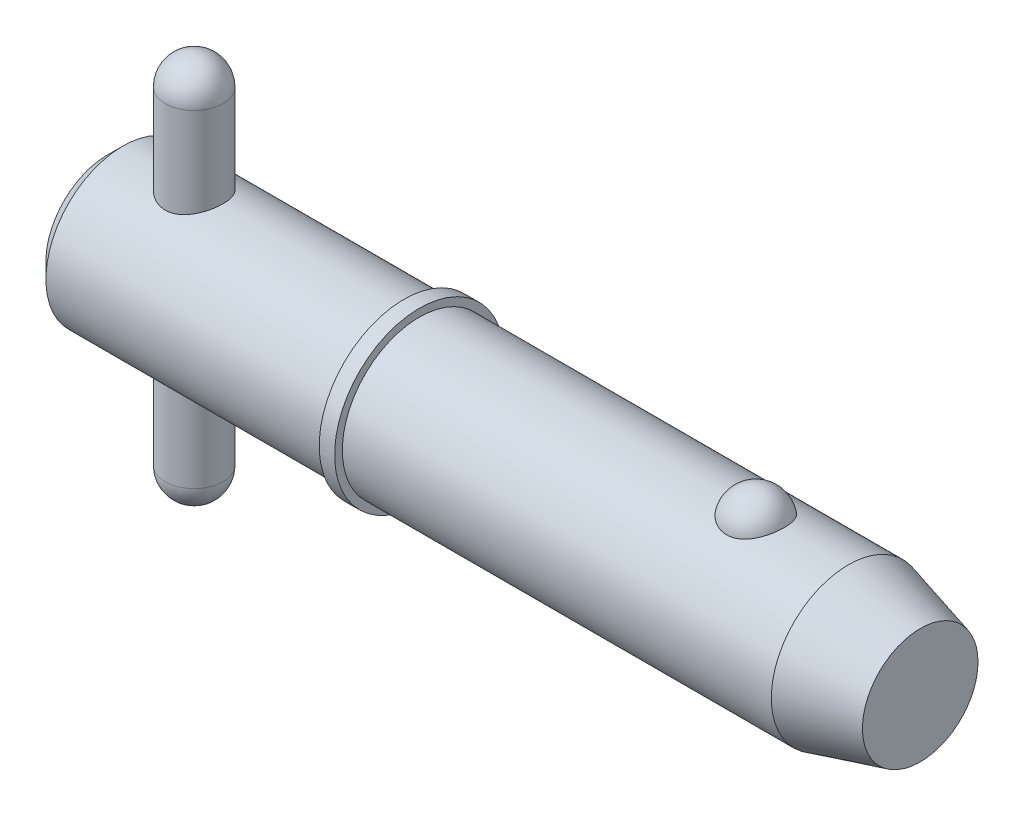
ISO-10303-21;
HEADER;
FILE_DESCRIPTION(('STEP AP214'),'2;1');
FILE_NAME('part.step','',(''),(''),'','','');
FILE_SCHEMA(('AUTOMOTIVE_DESIGN { 1 0 10303 214 1 1 1 1 }'));
ENDSEC;
DATA;
#1=APPLICATION_CONTEXT('core data for automotive mechanical design processes');
#2=APPLICATION_PROTOCOL_DEFINITION('international standard','automotive_design',2000,#1);
#3=PRODUCT_CONTEXT('',#1,'mechanical');
#4=PRODUCT('Part','Part','',(#3));
#5=PRODUCT_RELATED_PRODUCT_CATEGORY('part','',(#4));
#6=PRODUCT_DEFINITION_FORMATION('','',#4);
#7=PRODUCT_DEFINITION_CONTEXT('part definition',#1,'design');
#8=PRODUCT_DEFINITION('design','',#6,#7);
#9=PRODUCT_DEFINITION_SHAPE('','',#8);
#10=(LENGTH_UNIT() NAMED_UNIT(*) SI_UNIT(.MILLI.,.METRE.));
#11=(NAMED_UNIT(*) PLANE_ANGLE_UNIT() SI_UNIT($,.RADIAN.));
#12=(NAMED_UNIT(*) SI_UNIT($,.STERADIAN.) SOLID_ANGLE_UNIT());
#13=UNCERTAINTY_MEASURE_WITH_UNIT(LENGTH_MEASURE(1.E-05),#10,'distance_accuracy_value','');
#14=(GEOMETRIC_REPRESENTATION_CONTEXT(3) GLOBAL_UNCERTAINTY_ASSIGNED_CONTEXT((#13)) GLOBAL_UNIT_ASSIGNED_CONTEXT((#10,
#11,#12)) REPRESENTATION_CONTEXT('',''));
#15=CARTESIAN_POINT('',(0.,0.,0.));
#16=DIRECTION('',(0.,0.,1.));
#17=DIRECTION('',(1.,0.,0.));
#18=AXIS2_PLACEMENT_3D('',#15,#16,#17);
#19=CARTESIAN_POINT('',(7.14,15.875,0.));
#20=DIRECTION('',(0.,-1.,0.));
#21=DIRECTION('',(0.,0.,-1.));
#22=AXIS2_PLACEMENT_3D('',#19,#20,#21);
#23=CYLINDRICAL_SURFACE('',#22,2.38);
#24=CARTESIAN_POINT('',(7.14,-13.495,0.));
#25=DIRECTION('',(0.,-1.,0.));
#26=DIRECTION('',(0.,0.,-1.));
#27=AXIS2_PLACEMENT_3D('',#24,#25,#26);
#28=CIRCLE('',#27,2.38);
#29=CARTESIAN_POINT('',(7.14,-13.495,-2.38));
#30=VERTEX_POINT('',#29);
#31=EDGE_CURVE('P0_E10',#30,#30,#28,.F.);
#32=ORIENTED_EDGE('',*,*,#31,.T.);
#33=EDGE_LOOP('',(#32));
#34=FACE_BOUND('',#33,.T.);
#35=CARTESIAN_POINT('',(7.14,13.495,0.));
#36=DIRECTION('',(0.,-1.,0.));
#37=DIRECTION('',(0.,0.,-1.));
#38=AXIS2_PLACEMENT_3D('',#35,#36,#37);
#39=CIRCLE('',#38,2.38);
#40=CARTESIAN_POINT('',(7.14,13.495,-2.38));
#41=VERTEX_POINT('',#40);
#42=EDGE_CURVE('P0_E21',#41,#41,#39,.T.);
#43=ORIENTED_EDGE('',*,*,#42,.T.);
#44=EDGE_LOOP('',(#43));
#45=FACE_BOUND('',#44,.T.);
#46=ADVANCED_FACE('P0_F14',(#34,#45),#23,.T.);
#47=CARTESIAN_POINT('',(7.14,-13.495,0.));
#48=DIRECTION('',(0.,0.,1.));
#49=DIRECTION('',(1.,0.,0.));
#50=AXIS2_PLACEMENT_3D('',#47,#48,#49);
#51=SPHERICAL_SURFACE('',#50,2.38);
#52=CARTESIAN_POINT('',(7.14,-13.495,0.));
#53=DIRECTION('',(0.,-1.,0.));
#54=DIRECTION('',(0.,0.,-1.));
#55=AXIS2_PLACEMENT_3D('',#52,#53,#54);
#56=SPHERICAL_SURFACE('',#55,2.38);
#57=ORIENTED_EDGE('',*,*,#31,.F.);
#58=EDGE_LOOP('',(#57));
#59=FACE_BOUND('',#58,.T.);
#60=ADVANCED_FACE('P0_F29',(#59),#56,.T.);
#61=CARTESIAN_POINT('',(7.14,13.495,0.));
#62=DIRECTION('',(0.,0.,1.));
#63=DIRECTION('',(1.,0.,0.));
#64=AXIS2_PLACEMENT_3D('',#61,#62,#63);
#65=SPHERICAL_SURFACE('',#64,2.38);
#66=CARTESIAN_POINT('',(7.14,13.495,0.));
#67=DIRECTION('',(0.,-1.,0.));
#68=DIRECTION('',(0.,0.,-1.));
#69=AXIS2_PLACEMENT_3D('',#66,#67,#68);
#70=SPHERICAL_SURFACE('',#69,2.38);
#71=ORIENTED_EDGE('',*,*,#42,.F.);
#72=EDGE_LOOP('',(#71));
#73=FACE_BOUND('',#72,.T.);
#74=ADVANCED_FACE('P0_F16',(#73),#70,.T.);
#75=CLOSED_SHELL('',(#46,#60,#74));
#76=MANIFOLD_SOLID_BREP('P0_B1',#75);
#77=CARTESIAN_POINT('',(0.,0.,0.));
#78=DIRECTION('',(1.,0.,0.));
#79=DIRECTION('',(0.,0.,-1.));
#80=AXIS2_PLACEMENT_3D('',#77,#78,#79);
#81=CYLINDRICAL_SURFACE('',#80,6.35);
#82=CARTESIAN_POINT('',(61.0553693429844,0.,0.));
#83=DIRECTION('',(1.,0.,0.));
#84=DIRECTION('',(0.,0.,-1.));
#85=AXIS2_PLACEMENT_3D('',#82,#83,#84);
#86=CIRCLE('',#85,6.35);
#87=CARTESIAN_POINT('',(61.0553693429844,0.,-6.35));
#88=VERTEX_POINT('',#87);
#89=EDGE_CURVE('P1_E81',#88,#88,#86,.T.);
#90=ORIENTED_EDGE('',*,*,#89,.F.);
#91=EDGE_LOOP('',(#90));
#92=FACE_BOUND('',#91,.T.);
#93=CARTESIAN_POINT('',(25.7,0.,0.));
#94=DIRECTION('',(1.,0.,0.));
#95=DIRECTION('',(0.,0.,-1.));
#96=AXIS2_PLACEMENT_3D('',#93,#94,#95);
#97=CIRCLE('',#96,6.35);
#98=CARTESIAN_POINT('',(25.7,0.,-6.35));
#99=VERTEX_POINT('',#98);
#100=EDGE_CURVE('P1_E85',#99,#99,#97,.T.);
#101=ORIENTED_EDGE('',*,*,#100,.T.);
#102=EDGE_LOOP('',(#101));
#103=FACE_BOUND('',#102,.T.);
#104=CARTESIAN_POINT('',(53.4300214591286,5.87502187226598,2.40969251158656));
#105=CARTESIAN_POINT('',(53.3050305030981,5.87501645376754,2.40969773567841));
#106=CARTESIAN_POINT('',(53.1800806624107,5.87916061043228,2.39967292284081));
#107=CARTESIAN_POINT('',(52.9339091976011,5.89523112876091,2.35991730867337));
#108=CARTESIAN_POINT('',(52.8126863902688,5.90715499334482,2.33019283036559));
#109=CARTESIAN_POINT('',(52.5775170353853,5.9373956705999,2.25201402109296));
#110=CARTESIAN_POINT('',(52.4635602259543,5.95570321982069,2.20358681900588));
#111=CARTESIAN_POINT('',(52.24557352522,5.99672067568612,2.08937987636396));
#112=CARTESIAN_POINT('',(52.1415457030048,6.01943149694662,2.02359652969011));
#113=CARTESIAN_POINT('',(51.9429437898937,6.06760647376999,1.87428969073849));
#114=CARTESIAN_POINT('',(51.8487268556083,6.09313095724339,1.79031110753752));
#115=CARTESIAN_POINT('',(51.6752557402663,6.14375873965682,1.60800178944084));
#116=CARTESIAN_POINT('',(51.5960043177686,6.16886196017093,1.50966841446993));
#117=CARTESIAN_POINT('',(51.4508457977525,6.2172460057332,1.29645884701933));
#118=CARTESIAN_POINT('',(51.3856885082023,6.24039621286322,1.18104158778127));
#119=CARTESIAN_POINT('',(51.2747035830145,6.28117277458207,0.940351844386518));
#120=CARTESIAN_POINT('',(51.2288776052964,6.29879865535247,0.815078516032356));
#121=CARTESIAN_POINT('',(51.1570234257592,6.32692073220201,0.556494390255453));
#122=CARTESIAN_POINT('',(51.131249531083,6.33732517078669,0.423102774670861));
#123=CARTESIAN_POINT('',(51.1009885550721,6.34957673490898,0.153542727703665));
#124=CARTESIAN_POINT('',(51.0965009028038,6.35142408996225,0.0173743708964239));
#125=CARTESIAN_POINT('',(51.1088655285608,6.34638925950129,-0.253036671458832));
#126=CARTESIAN_POINT('',(51.1255949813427,6.33955731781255,-0.387285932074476));
#127=CARTESIAN_POINT('',(51.179843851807,6.31794129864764,-0.650851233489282));
#128=CARTESIAN_POINT('',(51.2173636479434,6.30315707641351,-0.780167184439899));
#129=CARTESIAN_POINT('',(51.312500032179,6.26711642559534,-1.03041949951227));
#130=CARTESIAN_POINT('',(51.370143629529,6.24585130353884,-1.1513443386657));
#131=CARTESIAN_POINT('',(51.5043522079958,6.19905619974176,-1.38129800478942));
#132=CARTESIAN_POINT('',(51.5809187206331,6.17352587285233,-1.49032586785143));
#133=CARTESIAN_POINT('',(51.7517538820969,6.12080227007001,-1.69393164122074));
#134=CARTESIAN_POINT('',(51.8461008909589,6.09360200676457,-1.78844209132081));
#135=CARTESIAN_POINT('',(52.0501196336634,6.0407043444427,-1.95970536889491));
#136=CARTESIAN_POINT('',(52.1597900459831,6.01500681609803,-2.03645972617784));
#137=CARTESIAN_POINT('',(52.3891876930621,5.96867714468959,-2.16845644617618));
#138=CARTESIAN_POINT('',(52.5086522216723,5.94794910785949,-2.22412062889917));
#139=CARTESIAN_POINT('',(52.7562188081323,5.91340580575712,-2.31440992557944));
#140=CARTESIAN_POINT('',(52.8843175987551,5.89958794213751,-2.34904294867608));
#141=CARTESIAN_POINT('',(53.138582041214,5.88111049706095,-2.39491590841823));
#142=CARTESIAN_POINT('',(53.2645207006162,5.876025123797,-2.40724512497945));
#143=CARTESIAN_POINT('',(53.5167867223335,5.87428980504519,-2.41147867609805));
#144=CARTESIAN_POINT('',(53.643114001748,5.87763817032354,-2.40338710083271));
#145=CARTESIAN_POINT('',(53.8884170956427,5.89212921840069,-2.36762715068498));
#146=CARTESIAN_POINT('',(54.0074992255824,5.90302431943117,-2.34058030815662));
#147=CARTESIAN_POINT('',(54.2392447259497,5.93113752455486,-2.2683906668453));
#148=CARTESIAN_POINT('',(54.3519075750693,5.94835614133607,-2.22324640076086));
#149=CARTESIAN_POINT('',(54.5704009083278,5.98773016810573,-2.11493806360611));
#150=CARTESIAN_POINT('',(54.6760289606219,6.00998499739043,-2.05140269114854));
#151=CARTESIAN_POINT('',(54.8753006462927,6.0569014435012,-1.90842705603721));
#152=CARTESIAN_POINT('',(54.9689415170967,6.08156361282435,-1.82898313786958));
#153=CARTESIAN_POINT('',(55.1466754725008,6.13211715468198,-1.65182429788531));
#154=CARTESIAN_POINT('',(55.230055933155,6.15800825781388,-1.55339381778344));
#155=CARTESIAN_POINT('',(55.3797900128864,6.20712834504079,-1.34374214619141));
#156=CARTESIAN_POINT('',(55.4461405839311,6.23035685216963,-1.23251867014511));
#157=CARTESIAN_POINT('',(55.5623455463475,6.27251177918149,-0.996447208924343));
#158=CARTESIAN_POINT('',(55.6116072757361,6.29127762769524,-0.871278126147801));
#159=CARTESIAN_POINT('',(55.6896142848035,6.3215862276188,-0.613870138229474));
#160=CARTESIAN_POINT('',(55.7183593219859,6.33312889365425,-0.481631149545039));
#161=CARTESIAN_POINT('',(55.7547705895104,6.34782349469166,-0.213672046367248));
#162=CARTESIAN_POINT('',(55.7624134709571,6.35096613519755,-0.0779482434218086));
#163=CARTESIAN_POINT('',(55.7563951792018,6.34851322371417,0.192943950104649));
#164=CARTESIAN_POINT('',(55.7427343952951,6.3429178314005,0.328112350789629));
#165=CARTESIAN_POINT('',(55.6945036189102,6.32360512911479,0.593406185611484));
#166=CARTESIAN_POINT('',(55.6600313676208,6.30992579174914,0.723552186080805));
#167=CARTESIAN_POINT('',(55.5709539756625,6.27586325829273,0.975834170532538));
#168=CARTESIAN_POINT('',(55.5163476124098,6.25547965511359,1.09796966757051));
#169=CARTESIAN_POINT('',(55.3877587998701,6.20998183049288,1.33148921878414));
#170=CARTESIAN_POINT('',(55.3136742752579,6.18484288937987,1.44281227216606));
#171=CARTESIAN_POINT('',(55.1478204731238,6.13258735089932,1.65087683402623));
#172=CARTESIAN_POINT('',(55.0560515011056,6.10547078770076,1.74761859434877));
#173=CARTESIAN_POINT('',(54.8571839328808,6.05235879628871,1.92350926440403));
#174=CARTESIAN_POINT('',(54.750133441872,6.02636017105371,2.00271146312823));
#175=CARTESIAN_POINT('',(54.5231384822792,5.97843747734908,2.14154159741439));
#176=CARTESIAN_POINT('',(54.403191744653,5.95651412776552,2.2011660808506));
#177=CARTESIAN_POINT('',(54.1445236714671,5.91812106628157,2.30250570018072));
#178=CARTESIAN_POINT('',(54.0050698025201,5.90217533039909,2.34256795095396));
#179=CARTESIAN_POINT('',(53.7203974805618,5.88063128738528,2.39615214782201));
#180=CARTESIAN_POINT('',(53.5751817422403,5.87502816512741,2.40968644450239));
#181=CARTESIAN_POINT('',(53.4300214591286,5.87502187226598,2.40969251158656));
#182=B_SPLINE_CURVE_WITH_KNOTS('',3,(#104,#105,#106,#107,#108,#109,#110,#111,#112,#113,#114,
#115,#116,#117,#118,#119,#120,#121,#122,#123,#124,#125,#126,#127,#128,#129,#130,#131,#132,#133,
#134,#135,#136,#137,#138,#139,#140,#141,#142,#143,#144,#145,#146,#147,#148,#149,#150,#151,#152,
#153,#154,#155,#156,#157,#158,#159,#160,#161,#162,#163,#164,#165,#166,#167,#168,#169,#170,#171,
#172,#173,#174,#175,#176,#177,#178,#179,#180,#181),.UNSPECIFIED.,.T.,.F.,(4,2,2,2,2,2,2,2,2,2,2,
2,2,2,2,2,2,2,2,2,2,2,2,2,2,2,2,2,2,2,2,2,2,2,2,2,2,2,4),(0.,0.374440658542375,
0.748761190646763,1.12254078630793,1.49639810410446,1.88098871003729,2.26565013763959,
2.66741104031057,3.0692063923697,3.47601794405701,3.88281858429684,4.28727498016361,
4.69173873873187,5.09674745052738,5.50178895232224,5.90865911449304,6.31549420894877,
6.71369855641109,7.11175305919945,7.48978077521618,7.86773278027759,8.23383886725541,
8.59997464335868,8.97409044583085,9.34829231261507,9.7412266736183,10.1342313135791,
10.539752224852,10.945277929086,11.3512521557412,11.7572189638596,12.1612938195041,
12.5653932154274,12.9716540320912,13.37790783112,13.782909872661,14.1879832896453,
14.6230486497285,15.0579114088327),.UNSPECIFIED.);
#183=CARTESIAN_POINT('',(53.4300214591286,5.87502187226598,2.40969251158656));
#184=VERTEX_POINT('',#183);
#185=EDGE_CURVE('P1_E35',#184,#184,#182,.T.);
#186=ORIENTED_EDGE('',*,*,#185,.T.);
#187=EDGE_LOOP('',(#186));
#188=FACE_BOUND('',#187,.T.);
#189=ADVANCED_FACE('P1_F13',(#92,#103,#188),#81,.T.);
#190=CARTESIAN_POINT('',(0.,0.,0.));
#191=DIRECTION('',(-1.,0.,0.));
#192=DIRECTION('',(0.,0.,1.));
#193=AXIS2_PLACEMENT_3D('',#190,#191,#192);
#194=PLANE('',#193);
#195=CARTESIAN_POINT('',(0.,0.,0.));
#196=DIRECTION('',(1.,0.,0.));
#197=DIRECTION('',(0.,0.,-1.));
#198=AXIS2_PLACEMENT_3D('',#195,#196,#197);
#199=CIRCLE('',#198,5.08);
#200=CARTESIAN_POINT('',(0.,0.,-5.08));
#201=VERTEX_POINT('',#200);
#202=EDGE_CURVE('P1_E9',#201,#201,#199,.T.);
#203=ORIENTED_EDGE('',*,*,#202,.F.);
#204=EDGE_LOOP('',(#203));
#205=FACE_BOUND('',#204,.T.);
#206=ADVANCED_FACE('P1_F15',(#205),#194,.T.);
#207=CARTESIAN_POINT('',(1.27,0.,0.));
#208=DIRECTION('',(1.,0.,0.));
#209=DIRECTION('',(0.,0.,-1.));
#210=AXIS2_PLACEMENT_3D('',#207,#208,#209);
#211=CONICAL_SURFACE('',#210,6.35,0.78539816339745);
#212=ORIENTED_EDGE('',*,*,#202,.T.);
#213=EDGE_LOOP('',(#212));
#214=FACE_BOUND('',#213,.T.);
#215=CARTESIAN_POINT('',(1.27,0.,0.));
#216=DIRECTION('',(1.,0.,0.));
#217=DIRECTION('',(0.,0.,-1.));
#218=AXIS2_PLACEMENT_3D('',#215,#216,#217);
#219=CIRCLE('',#218,6.35);
#220=CARTESIAN_POINT('',(1.27,0.,-6.35));
#221=VERTEX_POINT('',#220);
#222=EDGE_CURVE('P1_E26',#221,#221,#219,.T.);
#223=ORIENTED_EDGE('',*,*,#222,.F.);
#224=EDGE_LOOP('',(#223));
#225=FACE_BOUND('',#224,.T.);
#226=ADVANCED_FACE('P1_F77',(#214,#225),#211,.T.);
#227=CARTESIAN_POINT('',(0.,0.,0.));
#228=DIRECTION('',(1.,0.,0.));
#229=DIRECTION('',(0.,0.,-1.));
#230=AXIS2_PLACEMENT_3D('',#227,#228,#229);
#231=CYLINDRICAL_SURFACE('',#230,6.35);
#232=CARTESIAN_POINT('',(7.14,-5.88711304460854,2.38));
#233=CARTESIAN_POINT('',(7.01146258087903,-5.88710856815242,2.38000480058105));
#234=CARTESIAN_POINT('',(6.88295682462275,-5.89136840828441,2.36955244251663));
#235=CARTESIAN_POINT('',(6.62981934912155,-5.90782785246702,2.32820953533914));
#236=CARTESIAN_POINT('',(6.50518751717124,-5.92002722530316,2.29731958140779));
#237=CARTESIAN_POINT('',(6.26352403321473,-5.95079384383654,2.21639366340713));
#238=CARTESIAN_POINT('',(6.14647496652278,-5.96934583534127,2.16640353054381));
#239=CARTESIAN_POINT('',(5.92237941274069,-6.01070278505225,2.04885862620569));
#240=CARTESIAN_POINT('',(5.81533593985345,-6.03350901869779,1.98129858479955));
#241=CARTESIAN_POINT('',(5.60897525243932,-6.08207341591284,1.82693902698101));
#242=CARTESIAN_POINT('',(5.51022503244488,-6.10791836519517,1.73940861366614));
#243=CARTESIAN_POINT('',(5.32840561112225,-6.15892405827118,1.54914379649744));
#244=CARTESIAN_POINT('',(5.24533975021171,-6.1840846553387,1.44640616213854));
#245=CARTESIAN_POINT('',(5.09451639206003,-6.23191821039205,1.22434014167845));
#246=CARTESIAN_POINT('',(5.02737511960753,-6.25447755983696,1.10456656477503));
#247=CARTESIAN_POINT('',(4.91443001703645,-6.2935236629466,0.854429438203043));
#248=CARTESIAN_POINT('',(4.86861879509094,-6.31001251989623,0.724069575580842));
#249=CARTESIAN_POINT('',(4.80162253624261,-6.33444370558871,0.46242122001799));
#250=CARTESIAN_POINT('',(4.77946137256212,-6.34272370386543,0.331414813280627));
#251=CARTESIAN_POINT('',(4.75726677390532,-6.35101600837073,0.0672982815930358));
#252=CARTESIAN_POINT('',(4.75722615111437,-6.35103100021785,-0.0658111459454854));
#253=CARTESIAN_POINT('',(4.77870510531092,-6.3430064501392,-0.323358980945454));
#254=CARTESIAN_POINT('',(4.79915922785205,-6.33536494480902,-0.447900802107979));
#255=CARTESIAN_POINT('',(4.85925493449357,-6.31340794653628,-0.69163609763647));
#256=CARTESIAN_POINT('',(4.89889787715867,-6.29909198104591,-0.810829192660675));
#257=CARTESIAN_POINT('',(4.9967414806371,-6.26494471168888,-1.04254212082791));
#258=CARTESIAN_POINT('',(5.05520370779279,-6.24503620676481,-1.1549396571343));
#259=CARTESIAN_POINT('',(5.1887948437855,-6.20171869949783,-1.3686079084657));
#260=CARTESIAN_POINT('',(5.26392912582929,-6.17830856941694,-1.46987502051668));
#261=CARTESIAN_POINT('',(5.43386591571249,-6.12878580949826,-1.66468415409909));
#262=CARTESIAN_POINT('',(5.52956139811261,-6.10259519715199,-1.75742857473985));
#263=CARTESIAN_POINT('',(5.73530435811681,-6.05155777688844,-1.92585331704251));
#264=CARTESIAN_POINT('',(5.84535542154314,-6.02671130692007,-2.00152936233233));
#265=CARTESIAN_POINT('',(6.07982989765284,-5.98068420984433,-2.13519109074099));
#266=CARTESIAN_POINT('',(6.20451768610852,-5.95959698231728,-2.19274775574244));
#267=CARTESIAN_POINT('',(6.4628145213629,-5.92455622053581,-2.28574558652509));
#268=CARTESIAN_POINT('',(6.59641856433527,-5.91059872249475,-2.32119904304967));
#269=CARTESIAN_POINT('',(6.86087441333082,-5.8923327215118,-2.36717069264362));
#270=CARTESIAN_POINT('',(6.99147192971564,-5.8875347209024,-2.37895573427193));
#271=CARTESIAN_POINT('',(7.25283805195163,-5.88674545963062,-2.38091046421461));
#272=CARTESIAN_POINT('',(7.38360660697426,-5.89075200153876,-2.37108554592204));
#273=CARTESIAN_POINT('',(7.63510696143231,-5.90662331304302,-2.33124781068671));
#274=CARTESIAN_POINT('',(7.75602069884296,-5.91810660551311,-2.30221396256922));
#275=CARTESIAN_POINT('',(7.99120505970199,-5.94718527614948,-2.22601401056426));
#276=CARTESIAN_POINT('',(8.10547431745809,-5.96478190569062,-2.17884419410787));
#277=CARTESIAN_POINT('',(8.32888632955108,-6.00491533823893,-2.06572311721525));
#278=CARTESIAN_POINT('',(8.43767672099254,-6.02761250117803,-1.99913452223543));
#279=CARTESIAN_POINT('',(8.6429894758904,-6.07511988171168,-1.84974438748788));
#280=CARTESIAN_POINT('',(8.73950733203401,-6.09993087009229,-1.76693691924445));
#281=CARTESIAN_POINT('',(8.9238741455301,-6.1507686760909,-1.58125563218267));
#282=CARTESIAN_POINT('',(9.01078732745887,-6.17677301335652,-1.47744327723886));
#283=CARTESIAN_POINT('',(9.16607127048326,-6.22556172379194,-1.25606967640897));
#284=CARTESIAN_POINT('',(9.23444197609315,-6.24834608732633,-1.13850838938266));
#285=CARTESIAN_POINT('',(9.3502493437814,-6.28811144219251,-0.893050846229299));
#286=CARTESIAN_POINT('',(9.39775808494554,-6.30511236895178,-0.765192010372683));
#287=CARTESIAN_POINT('',(9.47032640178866,-6.33145833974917,-0.502514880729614));
#288=CARTESIAN_POINT('',(9.49539651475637,-6.34080697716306,-0.367699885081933));
#289=CARTESIAN_POINT('',(9.52124059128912,-6.35045496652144,-0.103396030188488));
#290=CARTESIAN_POINT('',(9.52334421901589,-6.35124952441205,0.025945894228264));
#291=CARTESIAN_POINT('',(9.50661518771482,-6.34499064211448,0.283061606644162));
#292=CARTESIAN_POINT('',(9.48778504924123,-6.33793814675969,0.410835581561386));
#293=CARTESIAN_POINT('',(9.43065630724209,-6.31700307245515,0.658028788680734));
#294=CARTESIAN_POINT('',(9.39284291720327,-6.30329098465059,0.7775756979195));
#295=CARTESIAN_POINT('',(9.29930406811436,-6.27046903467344,1.00863789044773));
#296=CARTESIAN_POINT('',(9.2435752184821,-6.25135815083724,1.12015164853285));
#297=CARTESIAN_POINT('',(9.11312349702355,-6.20865254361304,1.33711407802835));
#298=CARTESIAN_POINT('',(9.03770094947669,-6.18490316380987,1.44211105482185));
#299=CARTESIAN_POINT('',(8.87110640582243,-6.13583718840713,1.63836897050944));
#300=CARTESIAN_POINT('',(8.77992879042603,-6.11052003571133,1.72962498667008));
#301=CARTESIAN_POINT('',(8.57869799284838,-6.05953829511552,1.90076098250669));
#302=CARTESIAN_POINT('',(8.46790320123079,-6.03392573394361,1.97978778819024));
#303=CARTESIAN_POINT('',(8.23379693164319,-5.98676607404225,2.11813466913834));
#304=CARTESIAN_POINT('',(8.11048418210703,-5.9652193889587,2.17745273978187));
#305=CARTESIAN_POINT('',(7.84900037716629,-5.92818393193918,2.27641807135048));
#306=CARTESIAN_POINT('',(7.71041678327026,-5.91299857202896,2.31510015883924));
#307=CARTESIAN_POINT('',(7.42787316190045,-5.89246887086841,2.36688002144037));
#308=CARTESIAN_POINT('',(7.28391673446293,-5.88711805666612,2.37999462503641));
#309=CARTESIAN_POINT('',(7.14,-5.88711304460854,2.38));
#310=B_SPLINE_CURVE_WITH_KNOTS('',3,(#232,#233,#234,#235,#236,#237,#238,#239,#240,#241,#242,
#243,#244,#245,#246,#247,#248,#249,#250,#251,#252,#253,#254,#255,#256,#257,#258,#259,#260,#261,
#262,#263,#264,#265,#266,#267,#268,#269,#270,#271,#272,#273,#274,#275,#276,#277,#278,#279,#280,
#281,#282,#283,#284,#285,#286,#287,#288,#289,#290,#291,#292,#293,#294,#295,#296,#297,#298,#299,
#300,#301,#302,#303,#304,#305,#306,#307,#308,#309),.UNSPECIFIED.,.T.,.F.,(4,2,2,2,2,2,2,2,2,2,2,
2,2,2,2,2,2,2,2,2,2,2,2,2,2,2,2,2,2,2,2,2,2,2,2,2,2,2,4),(0.,0.385076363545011,
0.770141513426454,1.15428843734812,1.53855071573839,1.94016118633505,2.3418570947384,
2.75720522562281,3.1724093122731,3.569721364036,3.96690431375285,4.34445758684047,
4.72203759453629,5.10511017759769,5.48830640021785,5.89390240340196,6.29959991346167,
6.71428455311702,7.12873839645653,7.52034494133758,7.91185376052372,8.28480528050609,
8.65783318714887,9.0448340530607,9.43197664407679,9.84363087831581,10.2552863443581,
10.6655081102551,11.0755371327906,11.4616919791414,11.847800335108,12.224507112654,
12.6012852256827,12.9938941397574,13.386643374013,13.8000944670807,14.2135876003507,
14.6450218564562,15.0761720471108),.UNSPECIFIED.);
#311=CARTESIAN_POINT('',(7.14,-5.88711304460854,2.38));
#312=VERTEX_POINT('',#311);
#313=EDGE_CURVE('P1_E17',#312,#312,#310,.T.);
#314=ORIENTED_EDGE('',*,*,#313,.F.);
#315=EDGE_LOOP('',(#314));
#316=FACE_BOUND('',#315,.T.);
#317=CARTESIAN_POINT('',(7.14,5.88711304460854,2.38));
#318=CARTESIAN_POINT('',(7.26853741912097,5.88710856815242,2.38000480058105));
#319=CARTESIAN_POINT('',(7.39704317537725,5.89136840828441,2.36955244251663));
#320=CARTESIAN_POINT('',(7.65018065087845,5.90782785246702,2.32820953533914));
#321=CARTESIAN_POINT('',(7.77481248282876,5.92002722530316,2.29731958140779));
#322=CARTESIAN_POINT('',(8.01647596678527,5.95079384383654,2.21639366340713));
#323=CARTESIAN_POINT('',(8.13352503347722,5.96934583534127,2.16640353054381));
#324=CARTESIAN_POINT('',(8.35762058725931,6.01070278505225,2.04885862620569));
#325=CARTESIAN_POINT('',(8.46466406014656,6.03350901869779,1.98129858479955));
#326=CARTESIAN_POINT('',(8.67102474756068,6.08207341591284,1.82693902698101));
#327=CARTESIAN_POINT('',(8.76977496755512,6.10791836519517,1.73940861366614));
#328=CARTESIAN_POINT('',(8.95159438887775,6.15892405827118,1.54914379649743));
#329=CARTESIAN_POINT('',(9.03466024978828,6.1840846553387,1.44640616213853));
#330=CARTESIAN_POINT('',(9.18548360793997,6.23191821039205,1.22434014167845));
#331=CARTESIAN_POINT('',(9.25262488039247,6.25447755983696,1.10456656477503));
#332=CARTESIAN_POINT('',(9.36556998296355,6.2935236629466,0.854429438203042));
#333=CARTESIAN_POINT('',(9.41138120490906,6.31001251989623,0.72406957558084));
#334=CARTESIAN_POINT('',(9.47837746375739,6.33444370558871,0.462421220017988));
#335=CARTESIAN_POINT('',(9.50053862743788,6.34272370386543,0.331414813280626));
#336=CARTESIAN_POINT('',(9.52273322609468,6.35101600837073,0.0672982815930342));
#337=CARTESIAN_POINT('',(9.52277384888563,6.35103100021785,-0.0658111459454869));
#338=CARTESIAN_POINT('',(9.50129489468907,6.3430064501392,-0.323358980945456));
#339=CARTESIAN_POINT('',(9.48084077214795,6.33536494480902,-0.447900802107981));
#340=CARTESIAN_POINT('',(9.42074506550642,6.31340794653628,-0.691636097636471));
#341=CARTESIAN_POINT('',(9.38110212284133,6.29909198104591,-0.810829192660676));
#342=CARTESIAN_POINT('',(9.2832585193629,6.26494471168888,-1.04254212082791));
#343=CARTESIAN_POINT('',(9.22479629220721,6.24503620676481,-1.1549396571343));
#344=CARTESIAN_POINT('',(9.0912051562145,6.20171869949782,-1.3686079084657));
#345=CARTESIAN_POINT('',(9.0160708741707,6.17830856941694,-1.46987502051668));
#346=CARTESIAN_POINT('',(8.84613408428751,6.12878580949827,-1.66468415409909));
#347=CARTESIAN_POINT('',(8.75043860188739,6.10259519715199,-1.75742857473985));
#348=CARTESIAN_POINT('',(8.54469564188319,6.05155777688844,-1.92585331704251));
#349=CARTESIAN_POINT('',(8.43464457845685,6.02671130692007,-2.00152936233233));
#350=CARTESIAN_POINT('',(8.20017010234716,5.98068420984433,-2.13519109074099));
#351=CARTESIAN_POINT('',(8.07548231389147,5.95959698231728,-2.19274775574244));
#352=CARTESIAN_POINT('',(7.8171854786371,5.9245562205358,-2.28574558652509));
#353=CARTESIAN_POINT('',(7.68358143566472,5.91059872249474,-2.32119904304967));
#354=CARTESIAN_POINT('',(7.41912558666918,5.8923327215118,-2.36717069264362));
#355=CARTESIAN_POINT('',(7.28852807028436,5.8875347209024,-2.37895573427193));
#356=CARTESIAN_POINT('',(7.02716194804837,5.88674545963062,-2.38091046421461));
#357=CARTESIAN_POINT('',(6.89639339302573,5.89075200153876,-2.37108554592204));
#358=CARTESIAN_POINT('',(6.64489303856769,5.90662331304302,-2.33124781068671));
#359=CARTESIAN_POINT('',(6.52397930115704,5.91810660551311,-2.30221396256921));
#360=CARTESIAN_POINT('',(6.288794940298,5.94718527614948,-2.22601401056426));
#361=CARTESIAN_POINT('',(6.17452568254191,5.96478190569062,-2.17884419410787));
#362=CARTESIAN_POINT('',(5.95111367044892,6.00491533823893,-2.06572311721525));
#363=CARTESIAN_POINT('',(5.84232327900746,6.02761250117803,-1.99913452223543));
#364=CARTESIAN_POINT('',(5.6370105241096,6.07511988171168,-1.84974438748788));
#365=CARTESIAN_POINT('',(5.54049266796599,6.09993087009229,-1.76693691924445));
#366=CARTESIAN_POINT('',(5.3561258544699,6.1507686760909,-1.58125563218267));
#367=CARTESIAN_POINT('',(5.26921267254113,6.17677301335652,-1.47744327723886));
#368=CARTESIAN_POINT('',(5.11392872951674,6.22556172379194,-1.25606967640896));
#369=CARTESIAN_POINT('',(5.04555802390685,6.24834608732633,-1.13850838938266));
#370=CARTESIAN_POINT('',(4.9297506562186,6.28811144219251,-0.893050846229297));
#371=CARTESIAN_POINT('',(4.88224191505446,6.30511236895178,-0.76519201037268));
#372=CARTESIAN_POINT('',(4.80967359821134,6.33145833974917,-0.502514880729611));
#373=CARTESIAN_POINT('',(4.78460348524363,6.34080697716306,-0.36769988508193));
#374=CARTESIAN_POINT('',(4.75875940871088,6.35045496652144,-0.103396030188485));
#375=CARTESIAN_POINT('',(4.75665578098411,6.35124952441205,0.025945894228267));
#376=CARTESIAN_POINT('',(4.77338481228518,6.34499064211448,0.283061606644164));
#377=CARTESIAN_POINT('',(4.79221495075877,6.33793814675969,0.410835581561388));
#378=CARTESIAN_POINT('',(4.84934369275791,6.31700307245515,0.658028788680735));
#379=CARTESIAN_POINT('',(4.88715708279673,6.30329098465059,0.777575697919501));
#380=CARTESIAN_POINT('',(4.98069593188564,6.27046903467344,1.00863789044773));
#381=CARTESIAN_POINT('',(5.0364247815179,6.25135815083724,1.12015164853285));
#382=CARTESIAN_POINT('',(5.16687650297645,6.20865254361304,1.33711407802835));
#383=CARTESIAN_POINT('',(5.24229905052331,6.18490316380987,1.44211105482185));
#384=CARTESIAN_POINT('',(5.40889359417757,6.13583718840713,1.63836897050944));
#385=CARTESIAN_POINT('',(5.50007120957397,6.11052003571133,1.72962498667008));
#386=CARTESIAN_POINT('',(5.70130200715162,6.05953829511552,1.90076098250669));
#387=CARTESIAN_POINT('',(5.81209679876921,6.03392573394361,1.97978778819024));
#388=CARTESIAN_POINT('',(6.04620306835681,5.98676607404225,2.11813466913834));
#389=CARTESIAN_POINT('',(6.16951581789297,5.9652193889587,2.17745273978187));
#390=CARTESIAN_POINT('',(6.43099962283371,5.92818393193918,2.27641807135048));
#391=CARTESIAN_POINT('',(6.56958321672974,5.91299857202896,2.31510015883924));
#392=CARTESIAN_POINT('',(6.85212683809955,5.89246887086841,2.36688002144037));
#393=CARTESIAN_POINT('',(6.99608326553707,5.88711805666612,2.37999462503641));
#394=CARTESIAN_POINT('',(7.14,5.88711304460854,2.38));
#395=B_SPLINE_CURVE_WITH_KNOTS('',3,(#317,#318,#319,#320,#321,#322,#323,#324,#325,#326,#327,
#328,#329,#330,#331,#332,#333,#334,#335,#336,#337,#338,#339,#340,#341,#342,#343,#344,#345,#346,
#347,#348,#349,#350,#351,#352,#353,#354,#355,#356,#357,#358,#359,#360,#361,#362,#363,#364,#365,
#366,#367,#368,#369,#370,#371,#372,#373,#374,#375,#376,#377,#378,#379,#380,#381,#382,#383,#384,
#385,#386,#387,#388,#389,#390,#391,#392,#393,#394),.UNSPECIFIED.,.T.,.F.,(4,2,2,2,2,2,2,2,2,2,2,
2,2,2,2,2,2,2,2,2,2,2,2,2,2,2,2,2,2,2,2,2,2,2,2,2,2,2,4),(0.,0.385076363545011,
0.770141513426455,1.15428843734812,1.53855071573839,1.94016118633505,2.3418570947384,
2.75720522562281,3.1724093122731,3.56972136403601,3.96690431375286,4.34445758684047,
4.72203759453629,5.10511017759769,5.48830640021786,5.89390240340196,6.29959991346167,
6.71428455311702,7.12873839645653,7.52034494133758,7.91185376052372,8.2848052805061,
8.65783318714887,9.0448340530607,9.43197664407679,9.84363087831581,10.2552863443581,
10.6655081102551,11.0755371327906,11.4616919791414,11.847800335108,12.2245071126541,
12.6012852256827,12.9938941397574,13.386643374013,13.8000944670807,14.2135876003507,
14.6450218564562,15.0761720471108),.UNSPECIFIED.);
#396=CARTESIAN_POINT('',(7.14,5.88711304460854,2.38));
#397=VERTEX_POINT('',#396);
#398=EDGE_CURVE('P1_E43',#397,#397,#395,.T.);
#399=ORIENTED_EDGE('',*,*,#398,.F.);
#400=EDGE_LOOP('',(#399));
#401=FACE_BOUND('',#400,.T.);
#402=ORIENTED_EDGE('',*,*,#222,.T.);
#403=EDGE_LOOP('',(#402));
#404=FACE_BOUND('',#403,.T.);
#405=CARTESIAN_POINT('',(24.43,0.,0.));
#406=DIRECTION('',(1.,0.,0.));
#407=DIRECTION('',(0.,0.,-1.));
#408=AXIS2_PLACEMENT_3D('',#405,#406,#407);
#409=CIRCLE('',#408,6.35);
#410=CARTESIAN_POINT('',(24.43,0.,-6.35));
#411=VERTEX_POINT('',#410);
#412=EDGE_CURVE('P1_E31',#411,#411,#409,.T.);
#413=ORIENTED_EDGE('',*,*,#412,.F.);
#414=EDGE_LOOP('',(#413));
#415=FACE_BOUND('',#414,.T.);
#416=ADVANCED_FACE('P1_F103',(#316,#401,#404,#415),#231,.T.);
#417=CARTESIAN_POINT('',(24.43,6.35,0.));
#418=DIRECTION('',(-1.,0.,0.));
#419=DIRECTION('',(0.,0.,1.));
#420=AXIS2_PLACEMENT_3D('',#417,#418,#419);
#421=PLANE('',#420);
#422=ORIENTED_EDGE('',*,*,#412,.T.);
#423=EDGE_LOOP('',(#422));
#424=FACE_BOUND('',#423,.T.);
#425=CARTESIAN_POINT('',(24.43,0.,0.));
#426=DIRECTION('',(1.,0.,0.));
#427=DIRECTION('',(0.,0.,-1.));
#428=AXIS2_PLACEMENT_3D('',#425,#426,#427);
#429=CIRCLE('',#428,6.985);
#430=CARTESIAN_POINT('',(24.43,0.,-6.985));
#431=VERTEX_POINT('',#430);
#432=EDGE_CURVE('P1_E91',#431,#431,#429,.T.);
#433=ORIENTED_EDGE('',*,*,#432,.F.);
#434=EDGE_LOOP('',(#433));
#435=FACE_BOUND('',#434,.T.);
#436=ADVANCED_FACE('P1_F100',(#424,#435),#421,.T.);
#437=CARTESIAN_POINT('',(0.,0.,0.));
#438=DIRECTION('',(1.,0.,0.));
#439=DIRECTION('',(0.,0.,-1.));
#440=AXIS2_PLACEMENT_3D('',#437,#438,#439);
#441=CYLINDRICAL_SURFACE('',#440,6.985);
#442=ORIENTED_EDGE('',*,*,#432,.T.);
#443=EDGE_LOOP('',(#442));
#444=FACE_BOUND('',#443,.T.);
#445=CARTESIAN_POINT('',(25.7,0.,0.));
#446=DIRECTION('',(1.,0.,0.));
#447=DIRECTION('',(0.,0.,-1.));
#448=AXIS2_PLACEMENT_3D('',#445,#446,#447);
#449=CIRCLE('',#448,6.985);
#450=CARTESIAN_POINT('',(25.7,0.,-6.985));
#451=VERTEX_POINT('',#450);
#452=EDGE_CURVE('P1_E88',#451,#451,#449,.T.);
#453=ORIENTED_EDGE('',*,*,#452,.F.);
#454=EDGE_LOOP('',(#453));
#455=FACE_BOUND('',#454,.T.);
#456=ADVANCED_FACE('P1_F68',(#444,#455),#441,.T.);
#457=CARTESIAN_POINT('',(25.7,6.985,0.));
#458=DIRECTION('',(1.,0.,0.));
#459=DIRECTION('',(0.,0.,-1.));
#460=AXIS2_PLACEMENT_3D('',#457,#458,#459);
#461=PLANE('',#460);
#462=ORIENTED_EDGE('',*,*,#452,.T.);
#463=EDGE_LOOP('',(#462));
#464=FACE_BOUND('',#463,.T.);
#465=ORIENTED_EDGE('',*,*,#100,.F.);
#466=EDGE_LOOP('',(#465));
#467=FACE_BOUND('',#466,.T.);
#468=ADVANCED_FACE('P1_F62',(#464,#467),#461,.T.);
#469=CARTESIAN_POINT('',(66.98,0.,0.));
#470=DIRECTION('',(-1.,0.,0.));
#471=DIRECTION('',(0.,0.,1.));
#472=AXIS2_PLACEMENT_3D('',#469,#470,#471);
#473=CONICAL_SURFACE('',#472,4.76250000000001,0.26179938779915);
#474=ORIENTED_EDGE('',*,*,#89,.T.);
#475=EDGE_LOOP('',(#474));
#476=FACE_BOUND('',#475,.T.);
#477=CARTESIAN_POINT('',(66.98,0.,0.));
#478=DIRECTION('',(1.,0.,0.));
#479=DIRECTION('',(0.,0.,-1.));
#480=AXIS2_PLACEMENT_3D('',#477,#478,#479);
#481=CIRCLE('',#480,4.76250000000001);
#482=CARTESIAN_POINT('',(66.98,0.,-4.76250000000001));
#483=VERTEX_POINT('',#482);
#484=EDGE_CURVE('P1_E42',#483,#483,#481,.T.);
#485=ORIENTED_EDGE('',*,*,#484,.F.);
#486=EDGE_LOOP('',(#485));
#487=FACE_BOUND('',#486,.T.);
#488=ADVANCED_FACE('P1_F59',(#476,#487),#473,.T.);
#489=CARTESIAN_POINT('',(66.98,4.76250000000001,0.));
#490=DIRECTION('',(1.,0.,0.));
#491=DIRECTION('',(0.,0.,-1.));
#492=AXIS2_PLACEMENT_3D('',#489,#490,#491);
#493=PLANE('',#492);
#494=ORIENTED_EDGE('',*,*,#484,.T.);
#495=EDGE_LOOP('',(#494));
#496=FACE_BOUND('',#495,.T.);
#497=ADVANCED_FACE('P1_F55',(#496),#493,.T.);
#498=CARTESIAN_POINT('',(53.4300214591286,5.715,0.));
#499=DIRECTION('',(-1.,0.,0.));
#500=DIRECTION('',(0.,1.,0.));
#501=AXIS2_PLACEMENT_3D('',#498,#499,#500);
#502=SPHERICAL_SURFACE('',#501,2.41499999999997);
#503=ORIENTED_EDGE('',*,*,#185,.F.);
#504=EDGE_LOOP('',(#503));
#505=FACE_BOUND('',#504,.T.);
#506=ADVANCED_FACE('P1_F50',(#505),#502,.T.);
#507=CARTESIAN_POINT('',(7.14,-6.985,0.));
#508=DIRECTION('',(0.,1.,0.));
#509=DIRECTION('',(0.,0.,1.));
#510=AXIS2_PLACEMENT_3D('',#507,#508,#509);
#511=CYLINDRICAL_SURFACE('',#510,2.38);
#512=ORIENTED_EDGE('',*,*,#313,.T.);
#513=EDGE_LOOP('',(#512));
#514=FACE_BOUND('',#513,.T.);
#515=ORIENTED_EDGE('',*,*,#398,.T.);
#516=EDGE_LOOP('',(#515));
#517=FACE_BOUND('',#516,.T.);
#518=ADVANCED_FACE('P1_F54',(#514,#517),#511,.F.);
#519=CLOSED_SHELL('',(#189,#206,#226,#416,#436,#456,#468,#488,#497,#506,#518));
#520=MANIFOLD_SOLID_BREP('P1_B1',#519);
#521=ADVANCED_BREP_SHAPE_REPRESENTATION('',(#18,#76,#520),#14);
#522=SHAPE_DEFINITION_REPRESENTATION(#9,#521);
ENDSEC;
END-ISO-10303-21;
